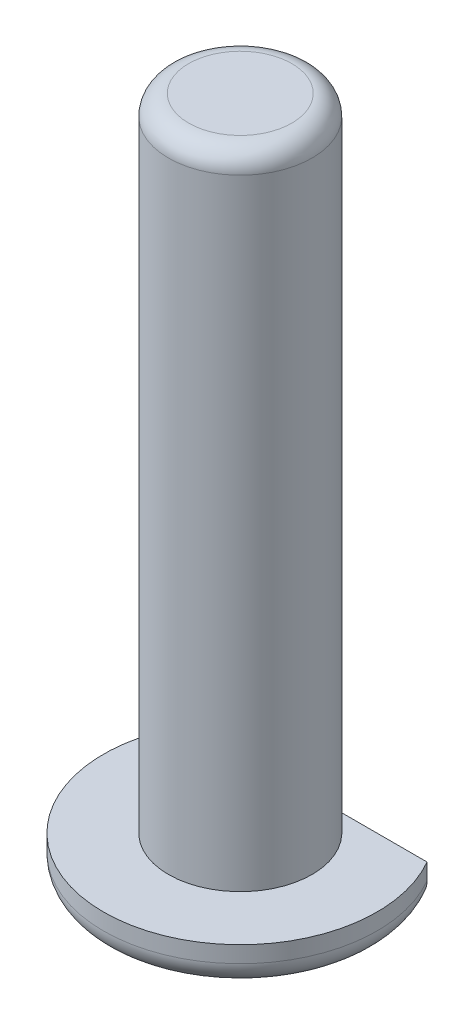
ISO-10303-21;
HEADER;
FILE_DESCRIPTION(('STEP AP214'),'2;1');
FILE_NAME('part.step','',(''),(''),'','','');
FILE_SCHEMA(('AUTOMOTIVE_DESIGN { 1 0 10303 214 1 1 1 1 }'));
ENDSEC;
DATA;
#1=APPLICATION_CONTEXT('core data for automotive mechanical design processes');
#2=APPLICATION_PROTOCOL_DEFINITION('international standard','automotive_design',2000,#1);
#3=PRODUCT_CONTEXT('',#1,'mechanical');
#4=PRODUCT('Part','Part','',(#3));
#5=PRODUCT_RELATED_PRODUCT_CATEGORY('part','',(#4));
#6=PRODUCT_DEFINITION_FORMATION('','',#4);
#7=PRODUCT_DEFINITION_CONTEXT('part definition',#1,'design');
#8=PRODUCT_DEFINITION('design','',#6,#7);
#9=PRODUCT_DEFINITION_SHAPE('','',#8);
#10=(LENGTH_UNIT() NAMED_UNIT(*) SI_UNIT(.MILLI.,.METRE.));
#11=(NAMED_UNIT(*) PLANE_ANGLE_UNIT() SI_UNIT($,.RADIAN.));
#12=(NAMED_UNIT(*) SI_UNIT($,.STERADIAN.) SOLID_ANGLE_UNIT());
#13=UNCERTAINTY_MEASURE_WITH_UNIT(LENGTH_MEASURE(1.E-05),#10,'distance_accuracy_value','');
#14=(GEOMETRIC_REPRESENTATION_CONTEXT(3) GLOBAL_UNCERTAINTY_ASSIGNED_CONTEXT((#13)) GLOBAL_UNIT_ASSIGNED_CONTEXT((#10,
#11,#12)) REPRESENTATION_CONTEXT('',''));
#15=CARTESIAN_POINT('',(0.,0.,0.));
#16=DIRECTION('',(0.,0.,1.));
#17=DIRECTION('',(1.,0.,0.));
#18=AXIS2_PLACEMENT_3D('',#15,#16,#17);
#19=CARTESIAN_POINT('',(0.,22.3012,0.));
#20=DIRECTION('',(0.,-1.,0.));
#21=DIRECTION('',(0.,0.,-1.));
#22=AXIS2_PLACEMENT_3D('',#19,#20,#21);
#23=CYLINDRICAL_SURFACE('',#22,2.667);
#24=CARTESIAN_POINT('',(0.,23.0512,0.));
#25=DIRECTION('',(0.,1.,0.));
#26=DIRECTION('',(0.,0.,1.));
#27=AXIS2_PLACEMENT_3D('',#24,#25,#26);
#28=CIRCLE('',#27,2.667);
#29=CARTESIAN_POINT('',(0.813196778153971,23.0512,-2.54));
#30=VERTEX_POINT('',#29);
#31=CARTESIAN_POINT('',(-0.81319677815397,23.0512,-2.54));
#32=VERTEX_POINT('',#31);
#33=EDGE_CURVE('E53',#30,#32,#28,.F.);
#34=ORIENTED_EDGE('',*,*,#33,.T.);
#35=DIRECTION('',(0.,-1.,0.));
#36=VECTOR('',#35,1.);
#37=CARTESIAN_POINT('',(-0.81319677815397,22.3012,-2.54));
#38=LINE('',#37,#36);
#39=CARTESIAN_POINT('',(-0.81319677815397,0.,-2.54));
#40=VERTEX_POINT('',#39);
#41=EDGE_CURVE('E59',#32,#40,#38,.T.);
#42=ORIENTED_EDGE('',*,*,#41,.T.);
#43=CARTESIAN_POINT('',(0.,0.,0.));
#44=DIRECTION('',(0.,1.,0.));
#45=DIRECTION('',(0.,0.,1.));
#46=AXIS2_PLACEMENT_3D('',#43,#44,#45);
#47=CIRCLE('',#46,2.667);
#48=CARTESIAN_POINT('',(0.81319677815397,0.,-2.54));
#49=VERTEX_POINT('',#48);
#50=EDGE_CURVE('E122',#40,#49,#47,.T.);
#51=ORIENTED_EDGE('',*,*,#50,.T.);
#52=DIRECTION('',(0.,-1.,0.));
#53=VECTOR('',#52,1.);
#54=CARTESIAN_POINT('',(0.81319677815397,22.3012,-2.54));
#55=LINE('',#54,#53);
#56=EDGE_CURVE('E99',#49,#30,#55,.F.);
#57=ORIENTED_EDGE('',*,*,#56,.T.);
#58=EDGE_LOOP('',(#34,#42,#51,#57));
#59=FACE_BOUND('',#58,.T.);
#60=ADVANCED_FACE('F39',(#59),#23,.T.);
#61=CARTESIAN_POINT('',(0.,-1.5,0.));
#62=DIRECTION('',(0.,1.,0.));
#63=DIRECTION('',(0.,0.,1.));
#64=AXIS2_PLACEMENT_3D('',#61,#62,#63);
#65=CYLINDRICAL_SURFACE('',#64,5.08);
#66=CARTESIAN_POINT('',(0.,-0.611,0.));
#67=DIRECTION('',(0.,-1.,0.));
#68=DIRECTION('',(0.,0.,-1.));
#69=AXIS2_PLACEMENT_3D('',#66,#67,#68);
#70=CIRCLE('',#69,5.08);
#71=CARTESIAN_POINT('',(-4.39940905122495,-0.610999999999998,-2.54));
#72=VERTEX_POINT('',#71);
#73=CARTESIAN_POINT('',(4.39940905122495,-0.611000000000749,-2.54));
#74=VERTEX_POINT('',#73);
#75=EDGE_CURVE('E107',#72,#74,#70,.F.);
#76=ORIENTED_EDGE('',*,*,#75,.T.);
#77=DIRECTION('',(0.,1.,0.));
#78=VECTOR('',#77,1.);
#79=CARTESIAN_POINT('',(4.39940905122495,-1.5,-2.54));
#80=LINE('',#79,#78);
#81=CARTESIAN_POINT('',(4.39940905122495,0.,-2.54));
#82=VERTEX_POINT('',#81);
#83=EDGE_CURVE('E87',#74,#82,#80,.T.);
#84=ORIENTED_EDGE('',*,*,#83,.T.);
#85=CARTESIAN_POINT('',(0.,0.,0.));
#86=DIRECTION('',(0.,-1.,0.));
#87=DIRECTION('',(0.,0.,-1.));
#88=AXIS2_PLACEMENT_3D('',#85,#86,#87);
#89=CIRCLE('',#88,5.08);
#90=CARTESIAN_POINT('',(-4.39940905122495,0.,-2.54));
#91=VERTEX_POINT('',#90);
#92=EDGE_CURVE('E138',#82,#91,#89,.T.);
#93=ORIENTED_EDGE('',*,*,#92,.T.);
#94=DIRECTION('',(0.,1.,0.));
#95=VECTOR('',#94,1.);
#96=CARTESIAN_POINT('',(-4.39940905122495,-1.5,-2.54));
#97=LINE('',#96,#95);
#98=EDGE_CURVE('E100',#72,#91,#97,.T.);
#99=ORIENTED_EDGE('',*,*,#98,.F.);
#100=EDGE_LOOP('',(#76,#84,#93,#99));
#101=FACE_BOUND('',#100,.T.);
#102=ADVANCED_FACE('F114',(#101),#65,.T.);
#103=CARTESIAN_POINT('',(0.,-1.5,0.));
#104=DIRECTION('',(0.,-1.,0.));
#105=DIRECTION('',(0.,0.,-1.));
#106=AXIS2_PLACEMENT_3D('',#103,#104,#105);
#107=PLANE('',#106);
#108=DIRECTION('',(1.,0.,0.));
#109=VECTOR('',#108,1.);
#110=CARTESIAN_POINT('',(4.39940905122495,-1.5,-2.54));
#111=LINE('',#110,#109);
#112=CARTESIAN_POINT('',(-3.3335988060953,-1.5,-2.54));
#113=VERTEX_POINT('',#112);
#114=CARTESIAN_POINT('',(3.3335988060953,-1.5,-2.54));
#115=VERTEX_POINT('',#114);
#116=EDGE_CURVE('E224',#113,#115,#111,.T.);
#117=ORIENTED_EDGE('',*,*,#116,.T.);
#118=CARTESIAN_POINT('',(0.,-1.5,0.));
#119=DIRECTION('',(0.,-1.,0.));
#120=DIRECTION('',(0.,0.,-1.));
#121=AXIS2_PLACEMENT_3D('',#118,#119,#120);
#122=CIRCLE('',#121,4.191);
#123=EDGE_CURVE('E109',#115,#113,#122,.T.);
#124=ORIENTED_EDGE('',*,*,#123,.T.);
#125=EDGE_LOOP('',(#117,#124));
#126=FACE_BOUND('',#125,.T.);
#127=ADVANCED_FACE('F163',(#126),#107,.T.);
#128=CARTESIAN_POINT('',(0.,0.,0.));
#129=DIRECTION('',(0.,-1.,0.));
#130=DIRECTION('',(0.,0.,-1.));
#131=AXIS2_PLACEMENT_3D('',#128,#129,#130);
#132=PLANE('',#131);
#133=ORIENTED_EDGE('',*,*,#92,.F.);
#134=DIRECTION('',(-1.,0.,0.));
#135=VECTOR('',#134,1.);
#136=CARTESIAN_POINT('',(0.,0.,-2.54));
#137=LINE('',#136,#135);
#138=EDGE_CURVE('E93',#82,#49,#137,.T.);
#139=ORIENTED_EDGE('',*,*,#138,.T.);
#140=ORIENTED_EDGE('',*,*,#50,.F.);
#141=EDGE_CURVE('E64',#40,#91,#137,.T.);
#142=ORIENTED_EDGE('',*,*,#141,.T.);
#143=EDGE_LOOP('',(#133,#139,#140,#142));
#144=FACE_BOUND('',#143,.T.);
#145=ADVANCED_FACE('F137',(#144),#132,.F.);
#146=CARTESIAN_POINT('',(0.,-0.611,0.));
#147=DIRECTION('',(0.,-1.,0.));
#148=DIRECTION('',(0.,0.,-1.));
#149=AXIS2_PLACEMENT_3D('',#146,#147,#148);
#150=TOROIDAL_SURFACE('',#149,4.191,0.889);
#151=CARTESIAN_POINT('',(-4.21020924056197,-1.12399163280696,-2.54));
#152=CARTESIAN_POINT('',(-4.23940375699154,-1.08860840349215,-2.54));
#153=CARTESIAN_POINT('',(-4.26587307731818,-1.05092857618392,-2.54));
#154=CARTESIAN_POINT('',(-4.31230826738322,-0.971709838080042,-2.54));
#155=CARTESIAN_POINT('',(-4.3322695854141,-0.930168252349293,-2.54));
#156=CARTESIAN_POINT('',(-4.36483580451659,-0.844136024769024,-2.54));
#157=CARTESIAN_POINT('',(-4.37741926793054,-0.799637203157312,-2.54));
#158=CARTESIAN_POINT('',(-4.39451099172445,-0.709120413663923,-2.54));
#159=CARTESIAN_POINT('',(-4.39902225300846,-0.663103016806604,-2.54));
#160=CARTESIAN_POINT('',(-4.39973140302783,-0.573141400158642,-2.54));
#161=CARTESIAN_POINT('',(-4.39630411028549,-0.529199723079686,-2.54));
#162=CARTESIAN_POINT('',(-4.38206843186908,-0.442535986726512,-2.54));
#163=CARTESIAN_POINT('',(-4.37126038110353,-0.399813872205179,-2.54));
#164=CARTESIAN_POINT('',(-4.34282923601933,-0.316972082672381,-2.54));
#165=CARTESIAN_POINT('',(-4.32524288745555,-0.276839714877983,-2.54));
#166=CARTESIAN_POINT('',(-4.28397442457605,-0.199855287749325,-2.54));
#167=CARTESIAN_POINT('',(-4.26029119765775,-0.163003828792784,-2.54));
#168=CARTESIAN_POINT('',(-4.20599142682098,-0.0910241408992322,-2.54));
#169=CARTESIAN_POINT('',(-4.17502684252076,-0.056159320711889,-2.54));
#170=CARTESIAN_POINT('',(-4.10825104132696,0.00855103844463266,-2.54));
#171=CARTESIAN_POINT('',(-4.07243796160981,0.0383946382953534,-2.54));
#172=CARTESIAN_POINT('',(-3.99248930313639,0.0960582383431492,-2.54));
#173=CARTESIAN_POINT('',(-3.94787069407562,0.123206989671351,-2.54));
#174=CARTESIAN_POINT('',(-3.85520435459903,0.170799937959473,-2.54));
#175=CARTESIAN_POINT('',(-3.80715481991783,0.191240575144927,-2.54));
#176=CARTESIAN_POINT('',(-3.70094541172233,0.228271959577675,-2.54));
#177=CARTESIAN_POINT('',(-3.64239268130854,0.243733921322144,-2.54));
#178=CARTESIAN_POINT('',(-3.52370769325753,0.266214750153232,-2.54));
#179=CARTESIAN_POINT('',(-3.46357468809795,0.273229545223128,-2.54));
#180=CARTESIAN_POINT('',(-3.33230725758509,0.279821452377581,-2.54));
#181=CARTESIAN_POINT('',(-3.2610958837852,0.277875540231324,-2.54));
#182=CARTESIAN_POINT('',(-3.11966587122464,0.263704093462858,-2.54));
#183=CARTESIAN_POINT('',(-3.04944845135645,0.251466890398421,-2.54));
#184=CARTESIAN_POINT('',(-2.90106635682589,0.214724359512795,-2.54));
#185=CARTESIAN_POINT('',(-2.82328574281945,0.188656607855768,-2.54));
#186=CARTESIAN_POINT('',(-2.67301174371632,0.124117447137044,-2.54));
#187=CARTESIAN_POINT('',(-2.60051559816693,0.0856525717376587,-2.54));
#188=CARTESIAN_POINT('',(-2.48458732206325,0.00975837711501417,-2.54));
#189=CARTESIAN_POINT('',(-2.43902279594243,-0.0244261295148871,-2.54));
#190=CARTESIAN_POINT('',(-2.35345199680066,-0.0991789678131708,-2.54));
#191=CARTESIAN_POINT('',(-2.31343584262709,-0.139735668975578,-2.54));
#192=CARTESIAN_POINT('',(-2.25146768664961,-0.215188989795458,-2.54));
#193=CARTESIAN_POINT('',(-2.22759287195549,-0.248499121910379,-2.54));
#194=CARTESIAN_POINT('',(-2.18533245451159,-0.318452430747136,-2.54));
#195=CARTESIAN_POINT('',(-2.16693836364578,-0.355090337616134,-2.54));
#196=CARTESIAN_POINT('',(-2.1398672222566,-0.424318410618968,-2.54));
#197=CARTESIAN_POINT('',(-2.13003842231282,-0.456454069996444,-2.54));
#198=CARTESIAN_POINT('',(-2.11592378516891,-0.521921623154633,-2.54));
#199=CARTESIAN_POINT('',(-2.11163308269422,-0.555252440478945,-2.54));
#200=CARTESIAN_POINT('',(-2.1090039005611,-0.622235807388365,-2.54));
#201=CARTESIAN_POINT('',(-2.11068020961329,-0.655888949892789,-2.54));
#202=CARTESIAN_POINT('',(-2.11984676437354,-0.722394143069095,-2.54));
#203=CARTESIAN_POINT('',(-2.12734028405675,-0.755245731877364,-2.54));
#204=CARTESIAN_POINT('',(-2.14721863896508,-0.81852545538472,-2.54));
#205=CARTESIAN_POINT('',(-2.15948051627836,-0.848993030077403,-2.54));
#206=CARTESIAN_POINT('',(-2.18807402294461,-0.907932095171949,-2.54));
#207=CARTESIAN_POINT('',(-2.2044074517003,-0.936402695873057,-2.54));
#208=CARTESIAN_POINT('',(-2.25174108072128,-1.00850029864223,-2.54));
#209=CARTESIAN_POINT('',(-2.28548494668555,-1.05032813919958,-2.54));
#210=CARTESIAN_POINT('',(-2.35912091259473,-1.12820339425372,-2.54));
#211=CARTESIAN_POINT('',(-2.39903164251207,-1.16423259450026,-2.54));
#212=CARTESIAN_POINT('',(-2.50083093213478,-1.24459610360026,-2.54));
#213=CARTESIAN_POINT('',(-2.56493931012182,-1.28611914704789,-2.54));
#214=CARTESIAN_POINT('',(-2.69888082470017,-1.35838600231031,-2.54));
#215=CARTESIAN_POINT('',(-2.7687168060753,-1.3891244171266,-2.54));
#216=CARTESIAN_POINT('',(-2.91376591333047,-1.44032614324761,-2.54));
#217=CARTESIAN_POINT('',(-2.98906262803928,-1.46055304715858,-2.54));
#218=CARTESIAN_POINT('',(-3.14191177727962,-1.48915615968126,-2.54));
#219=CARTESIAN_POINT('',(-3.21946496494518,-1.49752836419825,-2.54));
#220=CARTESIAN_POINT('',(-3.38132649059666,-1.50169689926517,-2.54));
#221=CARTESIAN_POINT('',(-3.46566863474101,-1.49640888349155,-2.54));
#222=CARTESIAN_POINT('',(-3.63177388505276,-1.46957636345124,-2.54));
#223=CARTESIAN_POINT('',(-3.71354064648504,-1.44805609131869,-2.54));
#224=CARTESIAN_POINT('',(-3.84589463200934,-1.39722894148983,-2.54));
#225=CARTESIAN_POINT('',(-3.89824192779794,-1.37245536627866,-2.54));
#226=CARTESIAN_POINT('',(-3.99810600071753,-1.31469205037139,-2.54));
#227=CARTESIAN_POINT('',(-4.0456363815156,-1.2817264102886,-2.54));
#228=CARTESIAN_POINT('',(-4.11166334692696,-1.22656737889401,-2.54));
#229=CARTESIAN_POINT('',(-4.13269299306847,-1.20735004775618,-2.54));
#230=CARTESIAN_POINT('',(-4.17290226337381,-1.16704802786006,-2.54));
#231=CARTESIAN_POINT('',(-4.19208112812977,-1.14596257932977,-2.54));
#232=CARTESIAN_POINT('',(-4.21020924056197,-1.12399163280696,-2.54));
#233=B_SPLINE_CURVE_WITH_KNOTS('',3,(#151,#152,#153,#154,#155,#156,#157,#158,#159,#160,#161,
#162,#163,#164,#165,#166,#167,#168,#169,#170,#171,#172,#173,#174,#175,#176,#177,#178,#179,#180,
#181,#182,#183,#184,#185,#186,#187,#188,#189,#190,#191,#192,#193,#194,#195,#196,#197,#198,#199,
#200,#201,#202,#203,#204,#205,#206,#207,#208,#209,#210,#211,#212,#213,#214,#215,#216,#217,#218,
#219,#220,#221,#222,#223,#224,#225,#226,#227,#228,#229,#230,#231,#232),.UNSPECIFIED.,.T.,.F.,(4,
2,2,2,2,2,2,2,2,2,2,2,2,2,2,2,2,2,2,2,2,2,2,2,2,2,2,2,2,2,2,2,2,2,2,2,2,2,2,2,4),(0.,
0.137524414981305,0.27514480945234,0.413163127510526,0.551130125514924,0.682716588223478,
0.814297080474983,0.945174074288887,1.07607496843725,1.21539771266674,1.35477413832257,
1.51085553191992,1.66701961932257,1.84801218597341,2.02909196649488,2.24198148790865,
2.45511271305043,2.70015271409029,2.94506378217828,3.11546874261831,3.28556621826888,
3.40811964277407,3.53048226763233,3.63087282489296,3.73117512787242,3.83172619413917,
3.93233389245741,4.03050306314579,4.12871569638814,4.28902777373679,4.44983397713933,
4.67776594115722,4.90581180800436,5.13878589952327,5.371838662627,5.62394878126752,
5.87568328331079,6.04876973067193,6.22135287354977,6.30671273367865,6.39210747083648),.UNSPECIFIED.);
#234=EDGE_CURVE('E111',#113,#72,#233,.T.);
#235=ORIENTED_EDGE('',*,*,#234,.F.);
#236=ORIENTED_EDGE('',*,*,#123,.F.);
#237=CARTESIAN_POINT('',(2.11007192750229,-0.625671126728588,-2.54));
#238=CARTESIAN_POINT('',(2.10910328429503,-0.587772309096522,-2.54));
#239=CARTESIAN_POINT('',(2.11195828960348,-0.549701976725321,-2.54));
#240=CARTESIAN_POINT('',(2.12500843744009,-0.474784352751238,-2.54));
#241=CARTESIAN_POINT('',(2.13522831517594,-0.437941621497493,-2.54));
#242=CARTESIAN_POINT('',(2.16175040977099,-0.367013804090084,-2.54));
#243=CARTESIAN_POINT('',(2.17798643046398,-0.332903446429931,-2.54));
#244=CARTESIAN_POINT('',(2.21529365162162,-0.267496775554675,-2.54));
#245=CARTESIAN_POINT('',(2.2363654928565,-0.236200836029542,-2.54));
#246=CARTESIAN_POINT('',(2.29494081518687,-0.160037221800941,-2.54));
#247=CARTESIAN_POINT('',(2.33509470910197,-0.117211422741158,-2.54));
#248=CARTESIAN_POINT('',(2.4215946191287,-0.0383276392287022,-2.54));
#249=CARTESIAN_POINT('',(2.46795745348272,-0.00228869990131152,-2.54));
#250=CARTESIAN_POINT('',(2.5829666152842,0.0753737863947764,-2.54));
#251=CARTESIAN_POINT('',(2.65352999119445,0.114163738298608,-2.54));
#252=CARTESIAN_POINT('',(2.79995416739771,0.179818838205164,-2.54));
#253=CARTESIAN_POINT('',(2.87581795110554,0.206677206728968,-2.54));
#254=CARTESIAN_POINT('',(3.03183867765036,0.248386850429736,-2.54));
#255=CARTESIAN_POINT('',(3.11203824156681,0.263079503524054,-2.54));
#256=CARTESIAN_POINT('',(3.27375180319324,0.27899983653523,-2.54));
#257=CARTESIAN_POINT('',(3.35526456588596,0.280239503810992,-2.54));
#258=CARTESIAN_POINT('',(3.50420309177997,0.269133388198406,-2.54));
#259=CARTESIAN_POINT('',(3.57178862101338,0.258937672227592,-2.54));
#260=CARTESIAN_POINT('',(3.70438608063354,0.227614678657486,-2.54));
#261=CARTESIAN_POINT('',(3.7694007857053,0.206499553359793,-2.54));
#262=CARTESIAN_POINT('',(3.88421268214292,0.15732012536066,-2.54));
#263=CARTESIAN_POINT('',(3.93474811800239,0.130983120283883,-2.54));
#264=CARTESIAN_POINT('',(4.03083309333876,0.0703264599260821,-2.54));
#265=CARTESIAN_POINT('',(4.07638341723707,0.0360080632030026,-2.54));
#266=CARTESIAN_POINT('',(4.16094015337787,-0.0405620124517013,-2.54));
#267=CARTESIAN_POINT('',(4.19989512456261,-0.0828710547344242,-2.54));
#268=CARTESIAN_POINT('',(4.26877106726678,-0.17431719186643,-2.54));
#269=CARTESIAN_POINT('',(4.29870011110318,-0.223448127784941,-2.54));
#270=CARTESIAN_POINT('',(4.34431523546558,-0.319829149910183,-2.54));
#271=CARTESIAN_POINT('',(4.36138525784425,-0.366425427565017,-2.54));
#272=CARTESIAN_POINT('',(4.38646241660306,-0.46199099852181,-2.54));
#273=CARTESIAN_POINT('',(4.39447641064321,-0.510958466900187,-2.54));
#274=CARTESIAN_POINT('',(4.40066126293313,-0.604516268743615,-2.54));
#275=CARTESIAN_POINT('',(4.39974549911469,-0.649048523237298,-2.54));
#276=CARTESIAN_POINT('',(4.39028332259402,-0.737286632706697,-2.54));
#277=CARTESIAN_POINT('',(4.38173850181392,-0.780992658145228,-2.54));
#278=CARTESIAN_POINT('',(4.35766099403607,-0.865491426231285,-2.54));
#279=CARTESIAN_POINT('',(4.34226866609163,-0.906324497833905,-2.54));
#280=CARTESIAN_POINT('',(4.30518663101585,-0.985011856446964,-2.54));
#281=CARTESIAN_POINT('',(4.28349596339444,-1.02286568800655,-2.54));
#282=CARTESIAN_POINT('',(4.23331124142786,-1.09677462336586,-2.54));
#283=CARTESIAN_POINT('',(4.2045134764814,-1.13262277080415,-2.54));
#284=CARTESIAN_POINT('',(4.14186400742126,-1.19957315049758,-2.54));
#285=CARTESIAN_POINT('',(4.10801048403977,-1.23067366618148,-2.54));
#286=CARTESIAN_POINT('',(4.03225542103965,-1.29099559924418,-2.54));
#287=CARTESIAN_POINT('',(3.98987718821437,-1.31961692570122,-2.54));
#288=CARTESIAN_POINT('',(3.90144112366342,-1.37042926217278,-2.54));
#289=CARTESIAN_POINT('',(3.85538144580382,-1.39261701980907,-2.54));
#290=CARTESIAN_POINT('',(3.75342694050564,-1.43355344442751,-2.54));
#291=CARTESIAN_POINT('',(3.69710940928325,-1.4512473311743,-2.54));
#292=CARTESIAN_POINT('',(3.58255311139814,-1.47847872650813,-2.54));
#293=CARTESIAN_POINT('',(3.52431337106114,-1.48801203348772,-2.54));
#294=CARTESIAN_POINT('',(3.39682281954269,-1.50033899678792,-2.54));
#295=CARTESIAN_POINT('',(3.32742948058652,-1.50166037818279,-2.54));
#296=CARTESIAN_POINT('',(3.18915452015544,-1.49433294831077,-2.54));
#297=CARTESIAN_POINT('',(3.12027342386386,-1.48567503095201,-2.54));
#298=CARTESIAN_POINT('',(2.97355911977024,-1.4568616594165,-2.54));
#299=CARTESIAN_POINT('',(2.89603895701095,-1.43510032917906,-2.54));
#300=CARTESIAN_POINT('',(2.74538347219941,-1.37954403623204,-2.54));
#301=CARTESIAN_POINT('',(2.67224865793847,-1.34574768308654,-2.54));
#302=CARTESIAN_POINT('',(2.54862527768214,-1.27516836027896,-2.54));
#303=CARTESIAN_POINT('',(2.49675806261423,-1.24079349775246,-2.54));
#304=CARTESIAN_POINT('',(2.39882199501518,-1.16457875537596,-2.54));
#305=CARTESIAN_POINT('',(2.35274211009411,-1.12275345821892,-2.54));
#306=CARTESIAN_POINT('',(2.28208607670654,-1.04550416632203,-2.54));
#307=CARTESIAN_POINT('',(2.25527677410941,-1.01212820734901,-2.54));
#308=CARTESIAN_POINT('',(2.20705398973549,-0.941638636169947,-2.54));
#309=CARTESIAN_POINT('',(2.18563458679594,-0.904529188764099,-2.54));
#310=CARTESIAN_POINT('',(2.15334085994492,-0.834448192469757,-2.54));
#311=CARTESIAN_POINT('',(2.14123171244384,-0.802049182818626,-2.54));
#312=CARTESIAN_POINT('',(2.12263191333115,-0.735719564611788,-2.54));
#313=CARTESIAN_POINT('',(2.11612369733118,-0.701794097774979,-2.54));
#314=CARTESIAN_POINT('',(2.1113104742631,-0.653665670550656,-2.54));
#315=CARTESIAN_POINT('',(2.11042997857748,-0.639680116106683,-2.54));
#316=CARTESIAN_POINT('',(2.11007192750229,-0.625671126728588,-2.54));
#317=B_SPLINE_CURVE_WITH_KNOTS('',3,(#237,#238,#239,#240,#241,#242,#243,#244,#245,#246,#247,
#248,#249,#250,#251,#252,#253,#254,#255,#256,#257,#258,#259,#260,#261,#262,#263,#264,#265,#266,
#267,#268,#269,#270,#271,#272,#273,#274,#275,#276,#277,#278,#279,#280,#281,#282,#283,#284,#285,
#286,#287,#288,#289,#290,#291,#292,#293,#294,#295,#296,#297,#298,#299,#300,#301,#302,#303,#304,
#305,#306,#307,#308,#309,#310,#311,#312,#313,#314,#315,#316),.UNSPECIFIED.,.T.,.F.,(4,2,2,2,2,2,
2,2,2,2,2,2,2,2,2,2,2,2,2,2,2,2,2,2,2,2,2,2,2,2,2,2,2,2,2,2,2,2,2,4),(0.,0.113675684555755,
0.227734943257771,0.340574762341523,0.453429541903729,0.628566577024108,0.804187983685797,
1.04450673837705,1.28496186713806,1.52850487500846,1.77183085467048,1.97607466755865,
2.18009166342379,2.3503605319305,2.52060256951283,2.69211669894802,2.86347697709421,
3.01151915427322,3.15944915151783,3.29242073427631,3.4253645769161,3.55570064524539,
3.68605660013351,3.82343944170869,3.96087183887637,4.11368900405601,4.26658328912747,
4.44300774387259,4.6195229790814,4.82694376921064,5.03455398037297,5.27509467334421,
5.51566316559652,5.70177170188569,5.88751989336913,6.01556241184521,6.14346364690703,
6.24682033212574,6.34985169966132,6.39187099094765),.UNSPECIFIED.);
#318=EDGE_CURVE('E90',#74,#115,#317,.T.);
#319=ORIENTED_EDGE('',*,*,#318,.F.);
#320=ORIENTED_EDGE('',*,*,#75,.F.);
#321=EDGE_LOOP('',(#235,#236,#319,#320));
#322=FACE_BOUND('',#321,.T.);
#323=ADVANCED_FACE('F106',(#322),#150,.T.);
#324=CARTESIAN_POINT('',(0.,23.8012,0.));
#325=DIRECTION('',(0.,1.,0.));
#326=DIRECTION('',(0.,0.,1.));
#327=AXIS2_PLACEMENT_3D('',#324,#325,#326);
#328=PLANE('',#327);
#329=CARTESIAN_POINT('',(0.,23.8012,0.));
#330=DIRECTION('',(0.,1.,0.));
#331=DIRECTION('',(0.,0.,1.));
#332=AXIS2_PLACEMENT_3D('',#329,#330,#331);
#333=CIRCLE('',#332,1.917);
#334=CARTESIAN_POINT('',(0.,23.8012,1.917));
#335=VERTEX_POINT('',#334);
#336=EDGE_CURVE('E116',#335,#335,#333,.T.);
#337=ORIENTED_EDGE('',*,*,#336,.T.);
#338=EDGE_LOOP('',(#337));
#339=FACE_BOUND('',#338,.T.);
#340=ADVANCED_FACE('F157',(#339),#328,.T.);
#341=CARTESIAN_POINT('',(0.,23.0512,0.));
#342=DIRECTION('',(0.,1.,0.));
#343=DIRECTION('',(0.,0.,1.));
#344=AXIS2_PLACEMENT_3D('',#341,#342,#343);
#345=TOROIDAL_SURFACE('',#344,1.917,0.75);
#346=CARTESIAN_POINT('',(0.,23.4687775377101,-2.54));
#347=CARTESIAN_POINT('',(0.0427678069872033,23.4687778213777,-2.54));
#348=CARTESIAN_POINT('',(0.0855371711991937,23.4671755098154,-2.54));
#349=CARTESIAN_POINT('',(0.170821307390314,23.4606534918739,-2.54));
#350=CARTESIAN_POINT('',(0.213336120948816,23.4557343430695,-2.54));
#351=CARTESIAN_POINT('',(0.297823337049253,23.4422162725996,-2.54));
#352=CARTESIAN_POINT('',(0.339795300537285,23.4336145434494,-2.54));
#353=CARTESIAN_POINT('',(0.422577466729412,23.4120784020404,-2.54));
#354=CARTESIAN_POINT('',(0.463389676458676,23.3991520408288,-2.54));
#355=CARTESIAN_POINT('',(0.539172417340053,23.3693633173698,-2.54));
#356=CARTESIAN_POINT('',(0.574330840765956,23.3529872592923,-2.54));
#357=CARTESIAN_POINT('',(0.641347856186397,23.3146295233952,-2.54));
#358=CARTESIAN_POINT('',(0.673228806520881,23.2926899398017,-2.54));
#359=CARTESIAN_POINT('',(0.714582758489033,23.2560479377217,-2.54));
#360=CARTESIAN_POINT('',(0.726582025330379,23.2442045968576,-2.54));
#361=CARTESIAN_POINT('',(0.748953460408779,23.2190281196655,-2.54));
#362=CARTESIAN_POINT('',(0.759324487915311,23.2056939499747,-2.54));
#363=CARTESIAN_POINT('',(0.777959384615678,23.1773731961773,-2.54));
#364=CARTESIAN_POINT('',(0.786197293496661,23.1623691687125,-2.54));
#365=CARTESIAN_POINT('',(0.799676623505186,23.1310692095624,-2.54));
#366=CARTESIAN_POINT('',(0.804924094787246,23.1147759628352,-2.54));
#367=CARTESIAN_POINT('',(0.811472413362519,23.0830841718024,-2.54));
#368=CARTESIAN_POINT('',(0.813112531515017,23.0677567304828,-2.54));
#369=CARTESIAN_POINT('',(0.813274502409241,23.0370859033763,-2.54));
#370=CARTESIAN_POINT('',(0.811797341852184,23.0217425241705,-2.54));
#371=CARTESIAN_POINT('',(0.806357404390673,22.9939524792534,-2.54));
#372=CARTESIAN_POINT('',(0.802808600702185,22.9814212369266,-2.54));
#373=CARTESIAN_POINT('',(0.793869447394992,22.9570416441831,-2.54));
#374=CARTESIAN_POINT('',(0.78847864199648,22.9451934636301,-2.54));
#375=CARTESIAN_POINT('',(0.773319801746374,22.9170490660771,-2.54));
#376=CARTESIAN_POINT('',(0.762679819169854,22.9012235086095,-2.54));
#377=CARTESIAN_POINT('',(0.739028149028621,22.8714575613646,-2.54));
#378=CARTESIAN_POINT('',(0.726010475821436,22.8575220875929,-2.54));
#379=CARTESIAN_POINT('',(0.690136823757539,22.8237408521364,-2.54));
#380=CARTESIAN_POINT('',(0.666006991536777,22.8052576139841,-2.54));
#381=CARTESIAN_POINT('',(0.615311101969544,22.7720785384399,-2.54));
#382=CARTESIAN_POINT('',(0.588740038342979,22.7573907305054,-2.54));
#383=CARTESIAN_POINT('',(0.511321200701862,22.7201199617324,-2.54));
#384=CARTESIAN_POINT('',(0.458732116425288,22.7011883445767,-2.54));
#385=CARTESIAN_POINT('',(0.351377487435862,22.6708655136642,-2.54));
#386=CARTESIAN_POINT('',(0.296603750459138,22.6595062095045,-2.54));
#387=CARTESIAN_POINT('',(0.195577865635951,22.6443535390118,-2.54));
#388=CARTESIAN_POINT('',(0.149464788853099,22.6396005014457,-2.54));
#389=CARTESIAN_POINT('',(0.0569678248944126,22.6339337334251,-2.54));
#390=CARTESIAN_POINT('',(0.0105837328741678,22.6330234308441,-2.54));
#391=CARTESIAN_POINT('',(-0.0819491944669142,22.6349698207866,-2.54));
#392=CARTESIAN_POINT('',(-0.128098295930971,22.6378138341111,-2.54));
#393=CARTESIAN_POINT('',(-0.219946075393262,22.6474781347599,-2.54));
#394=CARTESIAN_POINT('',(-0.265645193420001,22.6542940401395,-2.54));
#395=CARTESIAN_POINT('',(-0.346019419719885,22.6704599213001,-2.54));
#396=CARTESIAN_POINT('',(-0.380875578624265,22.6789030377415,-2.54));
#397=CARTESIAN_POINT('',(-0.449716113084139,22.6990394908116,-2.54));
#398=CARTESIAN_POINT('',(-0.483699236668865,22.7107372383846,-2.54));
#399=CARTESIAN_POINT('',(-0.550442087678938,22.7382247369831,-2.54));
#400=CARTESIAN_POINT('',(-0.583184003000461,22.7540585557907,-2.54));
#401=CARTESIAN_POINT('',(-0.645699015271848,22.790778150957,-2.54));
#402=CARTESIAN_POINT('',(-0.675485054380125,22.8116403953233,-2.54));
#403=CARTESIAN_POINT('',(-0.715296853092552,22.8470181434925,-2.54));
#404=CARTESIAN_POINT('',(-0.727476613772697,22.8591015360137,-2.54));
#405=CARTESIAN_POINT('',(-0.750130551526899,22.8848069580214,-2.54));
#406=CARTESIAN_POINT('',(-0.760604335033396,22.8984293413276,-2.54));
#407=CARTESIAN_POINT('',(-0.779346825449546,22.9273935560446,-2.54));
#408=CARTESIAN_POINT('',(-0.787585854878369,22.9427550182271,-2.54));
#409=CARTESIAN_POINT('',(-0.800907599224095,22.9747922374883,-2.54));
#410=CARTESIAN_POINT('',(-0.805997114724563,22.991465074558,-2.54));
#411=CARTESIAN_POINT('',(-0.812003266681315,23.0234282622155,-2.54));
#412=CARTESIAN_POINT('',(-0.813356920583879,23.0386357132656,-2.54));
#413=CARTESIAN_POINT('',(-0.813006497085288,23.0690148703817,-2.54));
#414=CARTESIAN_POINT('',(-0.811303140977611,23.0841865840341,-2.54));
#415=CARTESIAN_POINT('',(-0.805496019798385,23.1117481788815,-2.54));
#416=CARTESIAN_POINT('',(-0.80177638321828,23.1242222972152,-2.54));
#417=CARTESIAN_POINT('',(-0.792523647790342,23.1484707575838,-2.54));
#418=CARTESIAN_POINT('',(-0.786990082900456,23.1602449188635,-2.54));
#419=CARTESIAN_POINT('',(-0.771384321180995,23.1884351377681,-2.54));
#420=CARTESIAN_POINT('',(-0.760410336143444,23.2043510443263,-2.54));
#421=CARTESIAN_POINT('',(-0.736086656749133,23.2342465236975,-2.54));
#422=CARTESIAN_POINT('',(-0.722731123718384,23.2482211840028,-2.54));
#423=CARTESIAN_POINT('',(-0.68586343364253,23.2821758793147,-2.54));
#424=CARTESIAN_POINT('',(-0.661058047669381,23.3007415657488,-2.54));
#425=CARTESIAN_POINT('',(-0.608995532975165,23.3340064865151,-2.54));
#426=CARTESIAN_POINT('',(-0.581731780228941,23.3486948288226,-2.54));
#427=CARTESIAN_POINT('',(-0.502124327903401,23.3859839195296,-2.54));
#428=CARTESIAN_POINT('',(-0.448027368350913,23.4048051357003,-2.54));
#429=CARTESIAN_POINT('',(-0.337862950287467,23.4346429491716,-2.54));
#430=CARTESIAN_POINT('',(-0.281793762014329,23.4456525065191,-2.54));
#431=CARTESIAN_POINT('',(-0.18800423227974,23.4586816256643,-2.54));
#432=CARTESIAN_POINT('',(-0.150519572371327,23.4624845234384,-2.54));
#433=CARTESIAN_POINT('',(-0.075357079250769,23.4675331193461,-2.54));
#434=CARTESIAN_POINT('',(-0.0376791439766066,23.4687772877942,-2.54));
#435=CARTESIAN_POINT('',(0.,23.4687775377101,-2.54));
#436=B_SPLINE_CURVE_WITH_KNOTS('',3,(#346,#347,#348,#349,#350,#351,#352,#353,#354,#355,#356,
#357,#358,#359,#360,#361,#362,#363,#364,#365,#366,#367,#368,#369,#370,#371,#372,#373,#374,#375,
#376,#377,#378,#379,#380,#381,#382,#383,#384,#385,#386,#387,#388,#389,#390,#391,#392,#393,#394,
#395,#396,#397,#398,#399,#400,#401,#402,#403,#404,#405,#406,#407,#408,#409,#410,#411,#412,#413,
#414,#415,#416,#417,#418,#419,#420,#421,#422,#423,#424,#425,#426,#427,#428,#429,#430,#431,#432,
#433,#434,#435),.UNSPECIFIED.,.T.,.F.,(4,2,2,2,2,2,2,2,2,2,2,2,2,2,2,2,2,2,2,2,2,2,2,2,2,2,2,2,
2,2,2,2,2,2,2,2,2,2,2,2,2,2,2,2,4),(0.,0.128275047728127,0.256528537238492,0.384879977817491,
0.512993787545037,0.629022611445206,0.74419845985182,0.79466612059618,0.845168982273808,
0.896260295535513,0.947247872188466,0.993187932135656,1.03911345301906,1.07802651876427,
1.11694922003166,1.17383460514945,1.2308652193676,1.32153661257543,1.41239828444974,
1.57914632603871,1.74659267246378,1.8854941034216,2.0245194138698,2.16307640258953,
2.30148081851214,2.408951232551,2.51656801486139,2.62538180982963,2.73369594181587,
2.78504785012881,2.83641158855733,2.88842730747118,2.94033031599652,2.98583587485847,
3.03133069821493,3.07022474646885,3.10912879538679,3.16679691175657,3.22460840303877,
3.31703522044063,3.40971897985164,3.58059800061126,3.75163082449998,3.86457575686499,
3.97758819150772),.UNSPECIFIED.);
#437=EDGE_CURVE('E11',#32,#30,#436,.T.);
#438=ORIENTED_EDGE('',*,*,#437,.F.);
#439=ORIENTED_EDGE('',*,*,#33,.F.);
#440=EDGE_LOOP('',(#438,#439));
#441=FACE_BOUND('',#440,.T.);
#442=ORIENTED_EDGE('',*,*,#336,.F.);
#443=EDGE_LOOP('',(#442));
#444=FACE_BOUND('',#443,.T.);
#445=ADVANCED_FACE('F41',(#441,#444),#345,.T.);
#446=CARTESIAN_POINT('',(4.39940905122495,-1.5,-2.54));
#447=DIRECTION('',(0.,0.,1.));
#448=DIRECTION('',(1.,0.,0.));
#449=AXIS2_PLACEMENT_3D('',#446,#447,#448);
#450=PLANE('',#449);
#451=ORIENTED_EDGE('',*,*,#234,.T.);
#452=ORIENTED_EDGE('',*,*,#98,.T.);
#453=ORIENTED_EDGE('',*,*,#141,.F.);
#454=ORIENTED_EDGE('',*,*,#41,.F.);
#455=ORIENTED_EDGE('',*,*,#437,.T.);
#456=ORIENTED_EDGE('',*,*,#56,.F.);
#457=ORIENTED_EDGE('',*,*,#138,.F.);
#458=ORIENTED_EDGE('',*,*,#83,.F.);
#459=ORIENTED_EDGE('',*,*,#318,.T.);
#460=ORIENTED_EDGE('',*,*,#116,.F.);
#461=EDGE_LOOP('',(#451,#452,#453,#454,#455,#456,#457,#458,#459,#460));
#462=FACE_BOUND('',#461,.T.);
#463=ADVANCED_FACE('F89',(#462),#450,.F.);
#464=CLOSED_SHELL('',(#60,#102,#127,#145,#323,#340,#445,#463));
#465=MANIFOLD_SOLID_BREP('B2',#464);
#466=ADVANCED_BREP_SHAPE_REPRESENTATION('',(#18,#465),#14);
#467=SHAPE_DEFINITION_REPRESENTATION(#9,#466);
ENDSEC;
END-ISO-10303-21;
